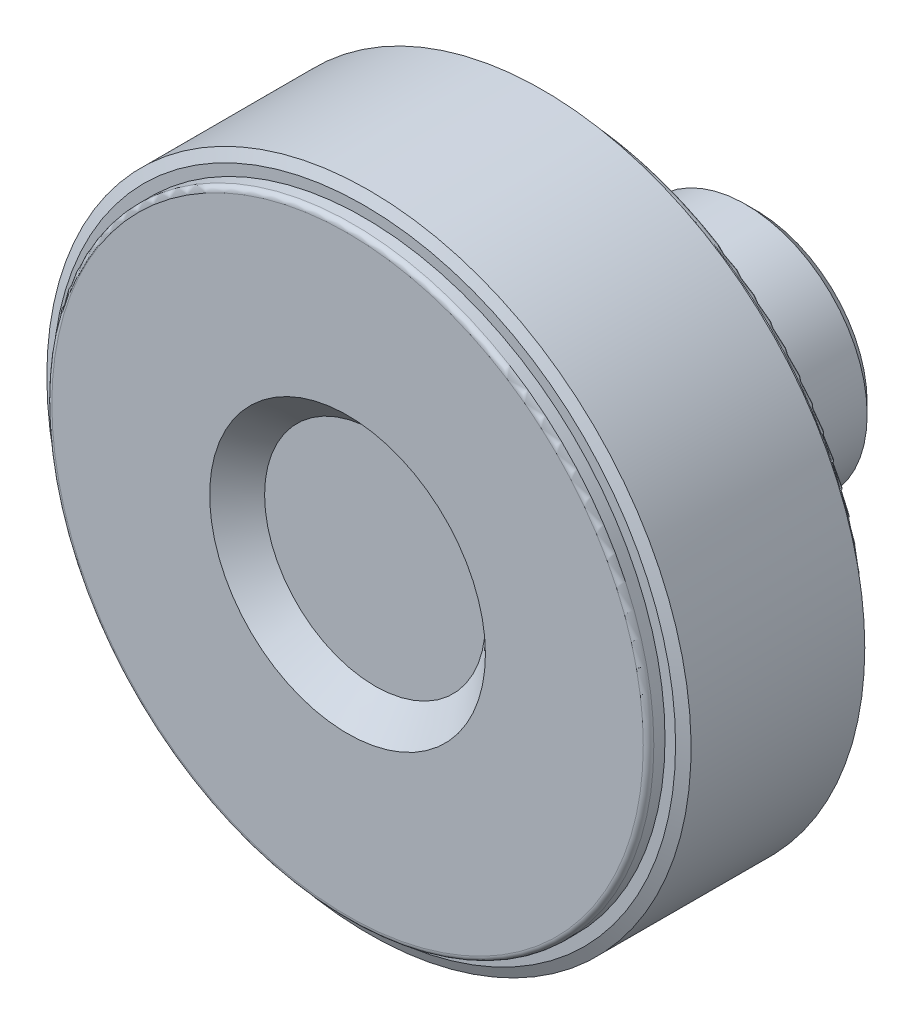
ISO-10303-21;
HEADER;
FILE_DESCRIPTION(('STEP AP214'),'2;1');
FILE_NAME('part.step','',(''),(''),'','','');
FILE_SCHEMA(('AUTOMOTIVE_DESIGN { 1 0 10303 214 1 1 1 1 }'));
ENDSEC;
DATA;
#1=APPLICATION_CONTEXT('core data for automotive mechanical design processes');
#2=APPLICATION_PROTOCOL_DEFINITION('international standard','automotive_design',2000,#1);
#3=PRODUCT_CONTEXT('',#1,'mechanical');
#4=PRODUCT('Part','Part','',(#3));
#5=PRODUCT_RELATED_PRODUCT_CATEGORY('part','',(#4));
#6=PRODUCT_DEFINITION_FORMATION('','',#4);
#7=PRODUCT_DEFINITION_CONTEXT('part definition',#1,'design');
#8=PRODUCT_DEFINITION('design','',#6,#7);
#9=PRODUCT_DEFINITION_SHAPE('','',#8);
#10=(LENGTH_UNIT() NAMED_UNIT(*) SI_UNIT(.MILLI.,.METRE.));
#11=(NAMED_UNIT(*) PLANE_ANGLE_UNIT() SI_UNIT($,.RADIAN.));
#12=(NAMED_UNIT(*) SI_UNIT($,.STERADIAN.) SOLID_ANGLE_UNIT());
#13=UNCERTAINTY_MEASURE_WITH_UNIT(LENGTH_MEASURE(1.E-05),#10,'distance_accuracy_value','');
#14=(GEOMETRIC_REPRESENTATION_CONTEXT(3) GLOBAL_UNCERTAINTY_ASSIGNED_CONTEXT((#13)) GLOBAL_UNIT_ASSIGNED_CONTEXT((#10,
#11,#12)) REPRESENTATION_CONTEXT('',''));
#15=CARTESIAN_POINT('',(0.,0.,0.));
#16=DIRECTION('',(0.,0.,1.));
#17=DIRECTION('',(1.,0.,0.));
#18=AXIS2_PLACEMENT_3D('',#15,#16,#17);
#19=CARTESIAN_POINT('',(0.,4.,0.));
#20=DIRECTION('',(0.,0.,-1.));
#21=DIRECTION('',(-1.,0.,0.));
#22=AXIS2_PLACEMENT_3D('',#19,#20,#21);
#23=PLANE('',#22);
#24=CARTESIAN_POINT('',(0.,0.,0.));
#25=DIRECTION('',(0.,0.,-1.));
#26=DIRECTION('',(-1.,0.,0.));
#27=AXIS2_PLACEMENT_3D('',#24,#25,#26);
#28=CIRCLE('',#27,7.00000000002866);
#29=CARTESIAN_POINT('',(-7.00000000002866,0.,0.));
#30=VERTEX_POINT('',#29);
#31=EDGE_CURVE('E9',#30,#30,#28,.F.);
#32=ORIENTED_EDGE('',*,*,#31,.T.);
#33=EDGE_LOOP('',(#32));
#34=FACE_BOUND('',#33,.T.);
#35=CARTESIAN_POINT('',(0.,0.,0.));
#36=DIRECTION('',(0.,0.,1.));
#37=DIRECTION('',(1.,0.,0.));
#38=AXIS2_PLACEMENT_3D('',#35,#36,#37);
#39=CIRCLE('',#38,8.);
#40=CARTESIAN_POINT('',(8.,0.,0.));
#41=VERTEX_POINT('',#40);
#42=EDGE_CURVE('E211',#41,#41,#39,.T.);
#43=ORIENTED_EDGE('',*,*,#42,.F.);
#44=EDGE_LOOP('',(#43));
#45=FACE_BOUND('',#44,.T.);
#46=ADVANCED_FACE('F14',(#34,#45),#23,.T.);
#47=CARTESIAN_POINT('',(0.,0.,0.15));
#48=DIRECTION('',(0.,0.,1.));
#49=DIRECTION('',(1.,0.,0.));
#50=AXIS2_PLACEMENT_3D('',#47,#48,#49);
#51=CYLINDRICAL_SURFACE('',#50,8.);
#52=ORIENTED_EDGE('',*,*,#42,.T.);
#53=EDGE_LOOP('',(#52));
#54=FACE_BOUND('',#53,.T.);
#55=CARTESIAN_POINT('',(0.,0.,0.3));
#56=DIRECTION('',(0.,0.,1.));
#57=DIRECTION('',(1.,0.,0.));
#58=AXIS2_PLACEMENT_3D('',#55,#56,#57);
#59=CIRCLE('',#58,8.);
#60=CARTESIAN_POINT('',(8.,0.,0.3));
#61=VERTEX_POINT('',#60);
#62=EDGE_CURVE('E208',#61,#61,#59,.T.);
#63=ORIENTED_EDGE('',*,*,#62,.F.);
#64=EDGE_LOOP('',(#63));
#65=FACE_BOUND('',#64,.T.);
#66=ADVANCED_FACE('F410',(#54,#65),#51,.T.);
#67=CARTESIAN_POINT('',(0.,9.25,0.3));
#68=DIRECTION('',(0.,0.,-1.));
#69=DIRECTION('',(-1.,0.,0.));
#70=AXIS2_PLACEMENT_3D('',#67,#68,#69);
#71=PLANE('',#70);
#72=CARTESIAN_POINT('',(0.,0.,0.3));
#73=DIRECTION('',(0.,0.,1.));
#74=DIRECTION('',(1.,0.,0.));
#75=AXIS2_PLACEMENT_3D('',#72,#73,#74);
#76=CIRCLE('',#75,10.5);
#77=CARTESIAN_POINT('',(10.5,0.,0.3));
#78=VERTEX_POINT('',#77);
#79=EDGE_CURVE('E177',#78,#78,#76,.T.);
#80=ORIENTED_EDGE('',*,*,#79,.F.);
#81=EDGE_LOOP('',(#80));
#82=FACE_BOUND('',#81,.T.);
#83=ORIENTED_EDGE('',*,*,#62,.T.);
#84=EDGE_LOOP('',(#83));
#85=FACE_BOUND('',#84,.T.);
#86=ADVANCED_FACE('F415',(#82,#85),#71,.T.);
#87=CARTESIAN_POINT('',(0.,0.,1.3));
#88=DIRECTION('',(0.,0.,1.));
#89=DIRECTION('',(1.,0.,0.));
#90=AXIS2_PLACEMENT_3D('',#87,#88,#89);
#91=CONICAL_SURFACE('',#90,11.5,0.785398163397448);
#92=ORIENTED_EDGE('',*,*,#79,.T.);
#93=EDGE_LOOP('',(#92));
#94=FACE_BOUND('',#93,.T.);
#95=CARTESIAN_POINT('',(0.,0.,1.3));
#96=DIRECTION('',(0.,0.,1.));
#97=DIRECTION('',(1.,0.,0.));
#98=AXIS2_PLACEMENT_3D('',#95,#96,#97);
#99=CIRCLE('',#98,11.5);
#100=CARTESIAN_POINT('',(11.5,0.,1.3));
#101=VERTEX_POINT('',#100);
#102=EDGE_CURVE('E174',#101,#101,#99,.T.);
#103=ORIENTED_EDGE('',*,*,#102,.F.);
#104=EDGE_LOOP('',(#103));
#105=FACE_BOUND('',#104,.T.);
#106=ADVANCED_FACE('F420',(#94,#105),#91,.T.);
#107=CARTESIAN_POINT('',(0.,0.,16.4));
#108=DIRECTION('',(0.,0.,1.));
#109=DIRECTION('',(1.,0.,0.));
#110=AXIS2_PLACEMENT_3D('',#107,#108,#109);
#111=CYLINDRICAL_SURFACE('',#110,11.5);
#112=ORIENTED_EDGE('',*,*,#102,.T.);
#113=EDGE_LOOP('',(#112));
#114=FACE_BOUND('',#113,.T.);
#115=CARTESIAN_POINT('',(0.,0.,31.5));
#116=DIRECTION('',(0.,0.,-1.));
#117=DIRECTION('',(-1.,0.,0.));
#118=AXIS2_PLACEMENT_3D('',#115,#116,#117);
#119=CIRCLE('',#118,11.5);
#120=CARTESIAN_POINT('',(-11.5,0.,31.5));
#121=VERTEX_POINT('',#120);
#122=EDGE_CURVE('E77',#121,#121,#119,.T.);
#123=ORIENTED_EDGE('',*,*,#122,.T.);
#124=EDGE_LOOP('',(#123));
#125=FACE_BOUND('',#124,.T.);
#126=ADVANCED_FACE('F427',(#114,#125),#111,.T.);
#127=CARTESIAN_POINT('',(0.,0.,31.5));
#128=DIRECTION('',(0.,0.,-1.));
#129=DIRECTION('',(-1.,0.,0.));
#130=AXIS2_PLACEMENT_3D('',#127,#128,#129);
#131=TOROIDAL_SURFACE('',#130,12.5,1.);
#132=CARTESIAN_POINT('',(0.,0.,32.5));
#133=DIRECTION('',(0.,0.,-1.));
#134=DIRECTION('',(1.,0.,0.));
#135=AXIS2_PLACEMENT_3D('',#132,#133,#134);
#136=CIRCLE('',#135,12.5);
#137=CARTESIAN_POINT('',(-12.5,0.,32.5));
#138=VERTEX_POINT('',#137);
#139=CARTESIAN_POINT('',(12.5,0.,32.5));
#140=VERTEX_POINT('',#139);
#141=EDGE_CURVE('E70',#138,#140,#136,.F.);
#142=ORIENTED_EDGE('',*,*,#141,.F.);
#143=CARTESIAN_POINT('',(0.,0.,32.5));
#144=DIRECTION('',(0.,0.,-1.));
#145=DIRECTION('',(-1.,0.,0.));
#146=AXIS2_PLACEMENT_3D('',#143,#144,#145);
#147=CIRCLE('',#146,12.5);
#148=CARTESIAN_POINT('',(0.,12.5,32.5));
#149=VERTEX_POINT('',#148);
#150=EDGE_CURVE('E73',#149,#138,#147,.F.);
#151=ORIENTED_EDGE('',*,*,#150,.F.);
#152=CARTESIAN_POINT('',(0.,0.,32.5));
#153=DIRECTION('',(0.,0.,-1.));
#154=DIRECTION('',(0.,1.,0.));
#155=AXIS2_PLACEMENT_3D('',#152,#153,#154);
#156=CIRCLE('',#155,12.5);
#157=EDGE_CURVE('E65',#140,#149,#156,.F.);
#158=ORIENTED_EDGE('',*,*,#157,.F.);
#159=EDGE_LOOP('',(#142,#151,#158));
#160=FACE_BOUND('',#159,.T.);
#161=ORIENTED_EDGE('',*,*,#122,.F.);
#162=EDGE_LOOP('',(#161));
#163=FACE_BOUND('',#162,.T.);
#164=ADVANCED_FACE('F68',(#160,#163),#131,.F.);
#165=CARTESIAN_POINT('',(0.,17.4807692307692,32.5));
#166=DIRECTION('',(0.,0.,-1.));
#167=DIRECTION('',(-1.,0.,0.));
#168=AXIS2_PLACEMENT_3D('',#165,#166,#167);
#169=PLANE('',#168);
#170=CARTESIAN_POINT('',(0.,0.,32.5));
#171=DIRECTION('',(0.,0.,1.));
#172=DIRECTION('',(-1.,0.,0.));
#173=AXIS2_PLACEMENT_3D('',#170,#171,#172);
#174=CIRCLE('',#173,22.4615384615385);
#175=CARTESIAN_POINT('',(22.4615384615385,0.,32.5));
#176=VERTEX_POINT('',#175);
#177=CARTESIAN_POINT('',(-22.4615384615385,0.,32.5));
#178=VERTEX_POINT('',#177);
#179=EDGE_CURVE('E83',#176,#178,#174,.F.);
#180=ORIENTED_EDGE('',*,*,#179,.T.);
#181=CARTESIAN_POINT('',(0.,0.,32.5));
#182=DIRECTION('',(0.,0.,1.));
#183=DIRECTION('',(0.,1.,0.));
#184=AXIS2_PLACEMENT_3D('',#181,#182,#183);
#185=CIRCLE('',#184,22.4615384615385);
#186=CARTESIAN_POINT('',(0.,22.4615384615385,32.5));
#187=VERTEX_POINT('',#186);
#188=EDGE_CURVE('E132',#178,#187,#185,.F.);
#189=ORIENTED_EDGE('',*,*,#188,.T.);
#190=CARTESIAN_POINT('',(0.,0.,32.5));
#191=DIRECTION('',(0.,0.,1.));
#192=DIRECTION('',(1.,0.,0.));
#193=AXIS2_PLACEMENT_3D('',#190,#191,#192);
#194=CIRCLE('',#193,22.4615384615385);
#195=EDGE_CURVE('E145',#187,#176,#194,.F.);
#196=ORIENTED_EDGE('',*,*,#195,.T.);
#197=EDGE_LOOP('',(#180,#189,#196));
#198=FACE_BOUND('',#197,.T.);
#199=ORIENTED_EDGE('',*,*,#150,.T.);
#200=ORIENTED_EDGE('',*,*,#141,.T.);
#201=ORIENTED_EDGE('',*,*,#157,.T.);
#202=EDGE_LOOP('',(#199,#200,#201));
#203=FACE_BOUND('',#202,.T.);
#204=ADVANCED_FACE('F81',(#198,#203),#169,.T.);
#205=CARTESIAN_POINT('',(0.,0.,31.5));
#206=DIRECTION('',(0.,0.,-1.));
#207=DIRECTION('',(-1.,0.,0.));
#208=AXIS2_PLACEMENT_3D('',#205,#206,#207);
#209=TOROIDAL_SURFACE('',#208,22.4615384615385,1.);
#210=ORIENTED_EDGE('',*,*,#188,.F.);
#211=ORIENTED_EDGE('',*,*,#179,.F.);
#212=ORIENTED_EDGE('',*,*,#195,.F.);
#213=EDGE_LOOP('',(#210,#211,#212));
#214=FACE_BOUND('',#213,.T.);
#215=CARTESIAN_POINT('',(0.,0.,31.5));
#216=DIRECTION('',(0.,0.,1.));
#217=DIRECTION('',(1.,0.,0.));
#218=AXIS2_PLACEMENT_3D('',#215,#216,#217);
#219=CIRCLE('',#218,23.4615384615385);
#220=CARTESIAN_POINT('',(23.4615384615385,0.,31.5));
#221=VERTEX_POINT('',#220);
#222=EDGE_CURVE('E205',#221,#221,#219,.F.);
#223=ORIENTED_EDGE('',*,*,#222,.T.);
#224=EDGE_LOOP('',(#223));
#225=FACE_BOUND('',#224,.T.);
#226=ADVANCED_FACE('F102',(#214,#225),#209,.F.);
#227=CARTESIAN_POINT('',(0.,0.,25.));
#228=DIRECTION('',(0.,0.,1.));
#229=DIRECTION('',(1.,0.,0.));
#230=AXIS2_PLACEMENT_3D('',#227,#228,#229);
#231=CYLINDRICAL_SURFACE('',#230,23.4615384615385);
#232=ORIENTED_EDGE('',*,*,#222,.F.);
#233=EDGE_LOOP('',(#232));
#234=FACE_BOUND('',#233,.T.);
#235=CARTESIAN_POINT('',(0.,0.,18.5));
#236=DIRECTION('',(0.,0.,1.));
#237=DIRECTION('',(1.,0.,0.));
#238=AXIS2_PLACEMENT_3D('',#235,#236,#237);
#239=CIRCLE('',#238,23.4615384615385);
#240=CARTESIAN_POINT('',(23.4615384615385,0.,18.5));
#241=VERTEX_POINT('',#240);
#242=EDGE_CURVE('E201',#241,#241,#239,.T.);
#243=ORIENTED_EDGE('',*,*,#242,.F.);
#244=EDGE_LOOP('',(#243));
#245=FACE_BOUND('',#244,.T.);
#246=ADVANCED_FACE('F326',(#234,#245),#231,.F.);
#247=CARTESIAN_POINT('',(0.,25.7307692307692,18.5));
#248=DIRECTION('',(0.,0.,-1.));
#249=DIRECTION('',(-1.,0.,0.));
#250=AXIS2_PLACEMENT_3D('',#247,#248,#249);
#251=PLANE('',#250);
#252=CARTESIAN_POINT('',(0.,0.,18.5));
#253=DIRECTION('',(0.,0.,1.));
#254=DIRECTION('',(-1.,0.,0.));
#255=AXIS2_PLACEMENT_3D('',#252,#253,#254);
#256=CIRCLE('',#255,28.);
#257=CARTESIAN_POINT('',(-28.,0.,18.5));
#258=VERTEX_POINT('',#257);
#259=CARTESIAN_POINT('',(28.,0.,18.5));
#260=VERTEX_POINT('',#259);
#261=EDGE_CURVE('E261',#258,#260,#256,.T.);
#262=ORIENTED_EDGE('',*,*,#261,.F.);
#263=CARTESIAN_POINT('',(0.,0.,18.5));
#264=DIRECTION('',(0.,0.,1.));
#265=DIRECTION('',(0.,1.,0.));
#266=AXIS2_PLACEMENT_3D('',#263,#264,#265);
#267=CIRCLE('',#266,28.);
#268=CARTESIAN_POINT('',(0.,28.,18.5));
#269=VERTEX_POINT('',#268);
#270=EDGE_CURVE('E296',#269,#258,#267,.T.);
#271=ORIENTED_EDGE('',*,*,#270,.F.);
#272=CARTESIAN_POINT('',(0.,0.,18.5));
#273=DIRECTION('',(0.,0.,1.));
#274=DIRECTION('',(1.,0.,0.));
#275=AXIS2_PLACEMENT_3D('',#272,#273,#274);
#276=CIRCLE('',#275,28.);
#277=EDGE_CURVE('E204',#260,#269,#276,.T.);
#278=ORIENTED_EDGE('',*,*,#277,.F.);
#279=EDGE_LOOP('',(#262,#271,#278));
#280=FACE_BOUND('',#279,.T.);
#281=ORIENTED_EDGE('',*,*,#242,.T.);
#282=EDGE_LOOP('',(#281));
#283=FACE_BOUND('',#282,.T.);
#284=ADVANCED_FACE('F272',(#280,#283),#251,.T.);
#285=CARTESIAN_POINT('',(0.,0.,19.));
#286=DIRECTION('',(0.,0.,-1.));
#287=DIRECTION('',(-1.,0.,0.));
#288=AXIS2_PLACEMENT_3D('',#285,#286,#287);
#289=TOROIDAL_SURFACE('',#288,28.,0.5);
#290=ORIENTED_EDGE('',*,*,#270,.T.);
#291=ORIENTED_EDGE('',*,*,#261,.T.);
#292=ORIENTED_EDGE('',*,*,#277,.T.);
#293=EDGE_LOOP('',(#290,#291,#292));
#294=FACE_BOUND('',#293,.T.);
#295=CARTESIAN_POINT('',(0.,0.,19.));
#296=DIRECTION('',(0.,0.,1.));
#297=DIRECTION('',(1.,0.,0.));
#298=AXIS2_PLACEMENT_3D('',#295,#296,#297);
#299=CIRCLE('',#298,28.5);
#300=CARTESIAN_POINT('',(28.5,0.,19.));
#301=VERTEX_POINT('',#300);
#302=EDGE_CURVE('E200',#301,#301,#299,.T.);
#303=ORIENTED_EDGE('',*,*,#302,.F.);
#304=EDGE_LOOP('',(#303));
#305=FACE_BOUND('',#304,.T.);
#306=ADVANCED_FACE('F266',(#294,#305),#289,.T.);
#307=CARTESIAN_POINT('',(0.,0.,19.53));
#308=DIRECTION('',(0.,0.,1.));
#309=DIRECTION('',(1.,0.,0.));
#310=AXIS2_PLACEMENT_3D('',#307,#308,#309);
#311=CYLINDRICAL_SURFACE('',#310,28.5);
#312=ORIENTED_EDGE('',*,*,#302,.T.);
#313=EDGE_LOOP('',(#312));
#314=FACE_BOUND('',#313,.T.);
#315=CARTESIAN_POINT('',(0.,0.,20.06));
#316=DIRECTION('',(0.,0.,1.));
#317=DIRECTION('',(1.,0.,0.));
#318=AXIS2_PLACEMENT_3D('',#315,#316,#317);
#319=CIRCLE('',#318,28.5);
#320=CARTESIAN_POINT('',(28.5,0.,20.06));
#321=VERTEX_POINT('',#320);
#322=EDGE_CURVE('E197',#321,#321,#319,.T.);
#323=ORIENTED_EDGE('',*,*,#322,.F.);
#324=EDGE_LOOP('',(#323));
#325=FACE_BOUND('',#324,.T.);
#326=ADVANCED_FACE('F271',(#314,#325),#311,.T.);
#327=CARTESIAN_POINT('',(0.,29.,20.06));
#328=DIRECTION('',(0.,0.,-1.));
#329=DIRECTION('',(-1.,0.,0.));
#330=AXIS2_PLACEMENT_3D('',#327,#328,#329);
#331=PLANE('',#330);
#332=CARTESIAN_POINT('',(0.,0.,20.06));
#333=DIRECTION('',(0.,0.,1.));
#334=DIRECTION('',(1.,0.,0.));
#335=AXIS2_PLACEMENT_3D('',#332,#333,#334);
#336=CIRCLE('',#335,29.5);
#337=CARTESIAN_POINT('',(29.5,0.,20.06));
#338=VERTEX_POINT('',#337);
#339=EDGE_CURVE('E193',#338,#338,#336,.T.);
#340=ORIENTED_EDGE('',*,*,#339,.F.);
#341=EDGE_LOOP('',(#340));
#342=FACE_BOUND('',#341,.T.);
#343=ORIENTED_EDGE('',*,*,#322,.T.);
#344=EDGE_LOOP('',(#343));
#345=FACE_BOUND('',#344,.T.);
#346=ADVANCED_FACE('F340',(#342,#345),#331,.T.);
#347=CARTESIAN_POINT('',(0.,0.,20.526307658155));
#348=DIRECTION('',(0.,0.,1.));
#349=DIRECTION('',(1.,0.,0.));
#350=AXIS2_PLACEMENT_3D('',#347,#348,#349);
#351=CONICAL_SURFACE('',#350,30.5,1.13446401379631);
#352=CARTESIAN_POINT('',(-1.81188397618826E-13,-3.78364006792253E-12,20.526307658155));
#353=DIRECTION('',(0.,0.,-1.));
#354=DIRECTION('',(-1.,0.,0.));
#355=AXIS2_PLACEMENT_3D('',#352,#353,#354);
#356=CIRCLE('',#355,30.5000000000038);
#357=CARTESIAN_POINT('',(-30.500000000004,-3.78364006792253E-12,20.526307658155));
#358=VERTEX_POINT('',#357);
#359=EDGE_CURVE('E196',#358,#358,#356,.F.);
#360=ORIENTED_EDGE('',*,*,#359,.F.);
#361=EDGE_LOOP('',(#360));
#362=FACE_BOUND('',#361,.T.);
#363=ORIENTED_EDGE('',*,*,#339,.T.);
#364=EDGE_LOOP('',(#363));
#365=FACE_BOUND('',#364,.T.);
#366=ADVANCED_FACE('F337',(#362,#365),#351,.T.);
#367=CARTESIAN_POINT('',(0.,0.,20.));
#368=DIRECTION('',(0.,0.,-1.));
#369=DIRECTION('',(-1.,0.,0.));
#370=AXIS2_PLACEMENT_3D('',#367,#368,#369);
#371=PLANE('',#370);
#372=CARTESIAN_POINT('',(0.,0.,20.));
#373=DIRECTION('',(0.,0.,-1.));
#374=DIRECTION('',(-1.,0.,0.));
#375=AXIS2_PLACEMENT_3D('',#372,#373,#374);
#376=CIRCLE('',#375,6.00000000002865);
#377=CARTESIAN_POINT('',(-6.00000000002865,0.,20.));
#378=VERTEX_POINT('',#377);
#379=EDGE_CURVE('E214',#378,#378,#376,.T.);
#380=ORIENTED_EDGE('',*,*,#379,.T.);
#381=EDGE_LOOP('',(#380));
#382=FACE_BOUND('',#381,.T.);
#383=ADVANCED_FACE('F339',(#382),#371,.T.);
#384=CARTESIAN_POINT('',(0.,0.,20.));
#385=DIRECTION('',(0.,0.,-1.));
#386=DIRECTION('',(-1.,0.,0.));
#387=AXIS2_PLACEMENT_3D('',#384,#385,#386);
#388=CYLINDRICAL_SURFACE('',#387,6.00000000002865);
#389=CARTESIAN_POINT('',(0.,0.,1.));
#390=DIRECTION('',(0.,0.,-1.));
#391=DIRECTION('',(-1.,0.,0.));
#392=AXIS2_PLACEMENT_3D('',#389,#390,#391);
#393=CIRCLE('',#392,6.00000000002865);
#394=CARTESIAN_POINT('',(-6.00000000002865,0.,1.));
#395=VERTEX_POINT('',#394);
#396=EDGE_CURVE('E24',#395,#395,#393,.T.);
#397=ORIENTED_EDGE('',*,*,#396,.T.);
#398=EDGE_LOOP('',(#397));
#399=FACE_BOUND('',#398,.T.);
#400=ORIENTED_EDGE('',*,*,#379,.F.);
#401=EDGE_LOOP('',(#400));
#402=FACE_BOUND('',#401,.T.);
#403=ADVANCED_FACE('F348',(#399,#402),#388,.F.);
#404=CARTESIAN_POINT('',(0.,0.,1.));
#405=DIRECTION('',(0.,0.,-1.));
#406=DIRECTION('',(-1.,0.,0.));
#407=AXIS2_PLACEMENT_3D('',#404,#405,#406);
#408=CONICAL_SURFACE('',#407,6.00000000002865,0.785398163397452);
#409=ORIENTED_EDGE('',*,*,#31,.F.);
#410=EDGE_LOOP('',(#409));
#411=FACE_BOUND('',#410,.T.);
#412=ORIENTED_EDGE('',*,*,#396,.F.);
#413=EDGE_LOOP('',(#412));
#414=FACE_BOUND('',#413,.T.);
#415=ADVANCED_FACE('F16',(#411,#414),#408,.F.);
#416=CARTESIAN_POINT('',(0.,5.22727272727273,36.4));
#417=DIRECTION('',(0.,0.,1.));
#418=DIRECTION('',(1.,0.,0.));
#419=AXIS2_PLACEMENT_3D('',#416,#417,#418);
#420=PLANE('',#419);
#421=CARTESIAN_POINT('',(0.,0.,36.4));
#422=DIRECTION('',(0.,0.,1.));
#423=DIRECTION('',(1.,0.,0.));
#424=AXIS2_PLACEMENT_3D('',#421,#422,#423);
#425=CIRCLE('',#424,10.4545454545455);
#426=CARTESIAN_POINT('',(10.4545454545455,0.,36.4));
#427=VERTEX_POINT('',#426);
#428=EDGE_CURVE('E181',#427,#427,#425,.T.);
#429=ORIENTED_EDGE('',*,*,#428,.T.);
#430=EDGE_LOOP('',(#429));
#431=FACE_BOUND('',#430,.T.);
#432=ADVANCED_FACE('F239',(#431),#420,.T.);
#433=CARTESIAN_POINT('',(0.,0.,39.));
#434=DIRECTION('',(0.,0.,1.));
#435=DIRECTION('',(1.,0.,0.));
#436=AXIS2_PLACEMENT_3D('',#433,#434,#435);
#437=CONICAL_SURFACE('',#436,13.0545454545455,0.785398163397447);
#438=CARTESIAN_POINT('',(0.,0.,39.));
#439=DIRECTION('',(0.,0.,1.));
#440=DIRECTION('',(1.,0.,0.));
#441=AXIS2_PLACEMENT_3D('',#438,#439,#440);
#442=CIRCLE('',#441,13.0545454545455);
#443=CARTESIAN_POINT('',(13.0545454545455,0.,39.));
#444=VERTEX_POINT('',#443);
#445=EDGE_CURVE('E178',#444,#444,#442,.F.);
#446=ORIENTED_EDGE('',*,*,#445,.F.);
#447=EDGE_LOOP('',(#446));
#448=FACE_BOUND('',#447,.T.);
#449=ORIENTED_EDGE('',*,*,#428,.F.);
#450=EDGE_LOOP('',(#449));
#451=FACE_BOUND('',#450,.T.);
#452=ADVANCED_FACE('F237',(#448,#451),#437,.F.);
#453=CARTESIAN_POINT('',(0.,20.5272727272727,39.));
#454=DIRECTION('',(0.,0.,1.));
#455=DIRECTION('',(1.,0.,0.));
#456=AXIS2_PLACEMENT_3D('',#453,#454,#455);
#457=PLANE('',#456);
#458=ORIENTED_EDGE('',*,*,#445,.T.);
#459=EDGE_LOOP('',(#458));
#460=FACE_BOUND('',#459,.T.);
#461=CARTESIAN_POINT('',(0.,0.,39.));
#462=DIRECTION('',(0.,0.,-1.));
#463=DIRECTION('',(-1.,0.,0.));
#464=AXIS2_PLACEMENT_3D('',#461,#462,#463);
#465=CIRCLE('',#464,28.);
#466=CARTESIAN_POINT('',(0.,28.,39.));
#467=VERTEX_POINT('',#466);
#468=CARTESIAN_POINT('',(-28.,0.,39.));
#469=VERTEX_POINT('',#468);
#470=EDGE_CURVE('E216',#467,#469,#465,.F.);
#471=ORIENTED_EDGE('',*,*,#470,.T.);
#472=CARTESIAN_POINT('',(0.,0.,39.));
#473=DIRECTION('',(0.,0.,-1.));
#474=DIRECTION('',(1.,0.,0.));
#475=AXIS2_PLACEMENT_3D('',#472,#473,#474);
#476=CIRCLE('',#475,28.);
#477=CARTESIAN_POINT('',(28.,0.,39.));
#478=VERTEX_POINT('',#477);
#479=EDGE_CURVE('E33',#469,#478,#476,.F.);
#480=ORIENTED_EDGE('',*,*,#479,.T.);
#481=CARTESIAN_POINT('',(0.,0.,39.));
#482=DIRECTION('',(0.,0.,-1.));
#483=DIRECTION('',(0.,1.,0.));
#484=AXIS2_PLACEMENT_3D('',#481,#482,#483);
#485=CIRCLE('',#484,28.);
#486=EDGE_CURVE('E184',#478,#467,#485,.F.);
#487=ORIENTED_EDGE('',*,*,#486,.T.);
#488=EDGE_LOOP('',(#471,#480,#487));
#489=FACE_BOUND('',#488,.T.);
#490=ADVANCED_FACE('F235',(#460,#489),#457,.T.);
#491=CARTESIAN_POINT('',(0.,0.,38.5));
#492=DIRECTION('',(0.,0.,-1.));
#493=DIRECTION('',(-1.,0.,0.));
#494=AXIS2_PLACEMENT_3D('',#491,#492,#493);
#495=TOROIDAL_SURFACE('',#494,28.,0.5);
#496=CARTESIAN_POINT('',(0.,0.,38.5));
#497=DIRECTION('',(0.,0.,-1.));
#498=DIRECTION('',(-1.,0.,0.));
#499=AXIS2_PLACEMENT_3D('',#496,#497,#498);
#500=CIRCLE('',#499,28.5);
#501=CARTESIAN_POINT('',(-28.5,0.,38.5));
#502=VERTEX_POINT('',#501);
#503=EDGE_CURVE('E185',#502,#502,#500,.F.);
#504=ORIENTED_EDGE('',*,*,#503,.T.);
#505=EDGE_LOOP('',(#504));
#506=FACE_BOUND('',#505,.T.);
#507=ORIENTED_EDGE('',*,*,#479,.F.);
#508=ORIENTED_EDGE('',*,*,#470,.F.);
#509=ORIENTED_EDGE('',*,*,#486,.F.);
#510=EDGE_LOOP('',(#507,#508,#509));
#511=FACE_BOUND('',#510,.T.);
#512=ADVANCED_FACE('F223',(#506,#511),#495,.T.);
#513=CARTESIAN_POINT('',(0.,0.,37.97));
#514=DIRECTION('',(0.,0.,1.));
#515=DIRECTION('',(1.,0.,0.));
#516=AXIS2_PLACEMENT_3D('',#513,#514,#515);
#517=CYLINDRICAL_SURFACE('',#516,28.5);
#518=ORIENTED_EDGE('',*,*,#503,.F.);
#519=EDGE_LOOP('',(#518));
#520=FACE_BOUND('',#519,.T.);
#521=CARTESIAN_POINT('',(0.,0.,37.44));
#522=DIRECTION('',(0.,0.,1.));
#523=DIRECTION('',(1.,0.,0.));
#524=AXIS2_PLACEMENT_3D('',#521,#522,#523);
#525=CIRCLE('',#524,28.5);
#526=CARTESIAN_POINT('',(28.5,0.,37.44));
#527=VERTEX_POINT('',#526);
#528=EDGE_CURVE('E186',#527,#527,#525,.T.);
#529=ORIENTED_EDGE('',*,*,#528,.T.);
#530=EDGE_LOOP('',(#529));
#531=FACE_BOUND('',#530,.T.);
#532=ADVANCED_FACE('F234',(#520,#531),#517,.T.);
#533=CARTESIAN_POINT('',(0.,0.,36.973692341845));
#534=DIRECTION('',(0.,0.,-1.));
#535=DIRECTION('',(-1.,0.,0.));
#536=AXIS2_PLACEMENT_3D('',#533,#534,#535);
#537=CONICAL_SURFACE('',#536,30.5,1.13446401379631);
#538=CARTESIAN_POINT('',(0.,0.,37.44));
#539=DIRECTION('',(0.,0.,-1.));
#540=DIRECTION('',(-1.,0.,0.));
#541=AXIS2_PLACEMENT_3D('',#538,#539,#540);
#542=CIRCLE('',#541,29.5);
#543=CARTESIAN_POINT('',(-29.5,0.,37.44));
#544=VERTEX_POINT('',#543);
#545=EDGE_CURVE('E189',#544,#544,#542,.F.);
#546=ORIENTED_EDGE('',*,*,#545,.F.);
#547=EDGE_LOOP('',(#546));
#548=FACE_BOUND('',#547,.T.);
#549=CARTESIAN_POINT('',(0.,0.,36.973692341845));
#550=DIRECTION('',(0.,0.,-1.));
#551=DIRECTION('',(0.,1.,0.));
#552=AXIS2_PLACEMENT_3D('',#549,#550,#551);
#553=CIRCLE('',#552,30.5);
#554=CARTESIAN_POINT('',(0.,30.5,36.973692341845));
#555=VERTEX_POINT('',#554);
#556=EDGE_CURVE('E192',#555,#555,#553,.F.);
#557=ORIENTED_EDGE('',*,*,#556,.T.);
#558=EDGE_LOOP('',(#557));
#559=FACE_BOUND('',#558,.T.);
#560=ADVANCED_FACE('F360',(#548,#559),#537,.T.);
#561=CARTESIAN_POINT('',(0.,29.,37.44));
#562=DIRECTION('',(0.,0.,1.));
#563=DIRECTION('',(1.,0.,0.));
#564=AXIS2_PLACEMENT_3D('',#561,#562,#563);
#565=PLANE('',#564);
#566=ORIENTED_EDGE('',*,*,#528,.F.);
#567=EDGE_LOOP('',(#566));
#568=FACE_BOUND('',#567,.T.);
#569=ORIENTED_EDGE('',*,*,#545,.T.);
#570=EDGE_LOOP('',(#569));
#571=FACE_BOUND('',#570,.T.);
#572=ADVANCED_FACE('F358',(#568,#571),#565,.T.);
#573=CARTESIAN_POINT('',(-1.81188397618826E-13,-3.78364006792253E-12,0.));
#574=DIRECTION('',(0.,0.,-1.));
#575=DIRECTION('',(-1.,0.,0.));
#576=AXIS2_PLACEMENT_3D('',#573,#574,#575);
#577=CYLINDRICAL_SURFACE('',#576,30.5000000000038);
#578=ORIENTED_EDGE('',*,*,#359,.T.);
#579=EDGE_LOOP('',(#578));
#580=FACE_BOUND('',#579,.T.);
#581=ORIENTED_EDGE('',*,*,#556,.F.);
#582=EDGE_LOOP('',(#581));
#583=FACE_BOUND('',#582,.T.);
#584=ADVANCED_FACE('F355',(#580,#583),#577,.T.);
#585=CLOSED_SHELL('',(#46,#66,#86,#106,#126,#164,#204,#226,#246,#284,#306,#326,#346,#366,#383,
#403,#415,#432,#452,#490,#512,#532,#560,#572,#584));
#586=MANIFOLD_SOLID_BREP('B1',#585);
#587=ADVANCED_BREP_SHAPE_REPRESENTATION('',(#18,#586),#14);
#588=SHAPE_DEFINITION_REPRESENTATION(#9,#587);
ENDSEC;
END-ISO-10303-21;
